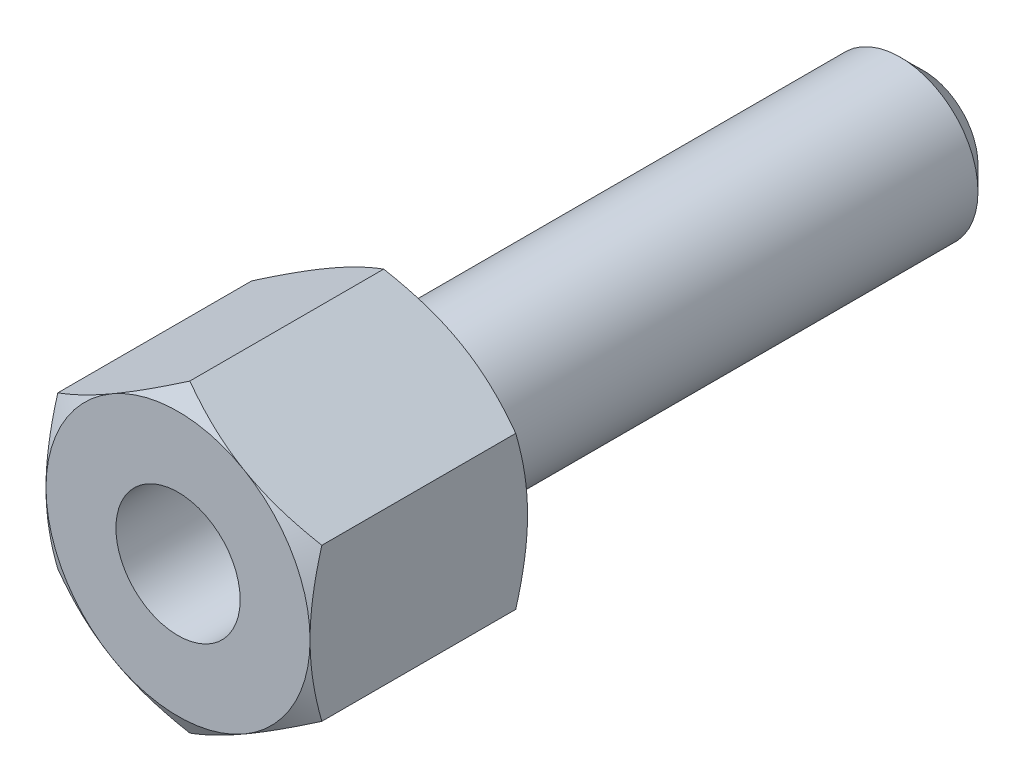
ISO-10303-21;
HEADER;
FILE_DESCRIPTION(('STEP AP214'),'2;1');
FILE_NAME('part.step','',(''),(''),'','','');
FILE_SCHEMA(('AUTOMOTIVE_DESIGN { 1 0 10303 214 1 1 1 1 }'));
ENDSEC;
DATA;
#1=APPLICATION_CONTEXT('core data for automotive mechanical design processes');
#2=APPLICATION_PROTOCOL_DEFINITION('international standard','automotive_design',2000,#1);
#3=PRODUCT_CONTEXT('',#1,'mechanical');
#4=PRODUCT('Part','Part','',(#3));
#5=PRODUCT_RELATED_PRODUCT_CATEGORY('part','',(#4));
#6=PRODUCT_DEFINITION_FORMATION('','',#4);
#7=PRODUCT_DEFINITION_CONTEXT('part definition',#1,'design');
#8=PRODUCT_DEFINITION('design','',#6,#7);
#9=PRODUCT_DEFINITION_SHAPE('','',#8);
#10=(LENGTH_UNIT() NAMED_UNIT(*) SI_UNIT(.MILLI.,.METRE.));
#11=(NAMED_UNIT(*) PLANE_ANGLE_UNIT() SI_UNIT($,.RADIAN.));
#12=(NAMED_UNIT(*) SI_UNIT($,.STERADIAN.) SOLID_ANGLE_UNIT());
#13=UNCERTAINTY_MEASURE_WITH_UNIT(LENGTH_MEASURE(1.E-05),#10,'distance_accuracy_value','');
#14=(GEOMETRIC_REPRESENTATION_CONTEXT(3) GLOBAL_UNCERTAINTY_ASSIGNED_CONTEXT((#13)) GLOBAL_UNIT_ASSIGNED_CONTEXT((#10,
#11,#12)) REPRESENTATION_CONTEXT('',''));
#15=CARTESIAN_POINT('',(0.,0.,0.));
#16=DIRECTION('',(0.,0.,1.));
#17=DIRECTION('',(1.,0.,0.));
#18=AXIS2_PLACEMENT_3D('',#15,#16,#17);
#19=CARTESIAN_POINT('',(8.5,4.90747728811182,14.));
#20=DIRECTION('',(-0.5,-0.866025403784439,0.));
#21=DIRECTION('',(0.866025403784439,-0.5,0.));
#22=AXIS2_PLACEMENT_3D('',#19,#20,#21);
#23=PLANE('',#22);
#24=CARTESIAN_POINT('',(-0.000200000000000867,9.81507004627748,0.75925604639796));
#25=CARTESIAN_POINT('',(0.186639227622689,9.70719836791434,0.696986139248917));
#26=CARTESIAN_POINT('',(0.374175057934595,9.59892450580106,0.637542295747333));
#27=CARTESIAN_POINT('',(0.75076975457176,9.3814974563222,0.525085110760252));
#28=CARTESIAN_POINT('',(0.939829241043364,9.27234391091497,0.472074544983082));
#29=CARTESIAN_POINT('',(1.51003475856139,8.94313560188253,0.323733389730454));
#30=CARTESIAN_POINT('',(1.89343164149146,8.72178130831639,0.239358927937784));
#31=CARTESIAN_POINT('',(2.46717766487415,8.39052888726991,0.140420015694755));
#32=CARTESIAN_POINT('',(2.65581276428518,8.28162036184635,0.112235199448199));
#33=CARTESIAN_POINT('',(3.0339360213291,8.06331079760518,0.0649740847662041));
#34=CARTESIAN_POINT('',(3.22342410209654,7.95390980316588,0.0458969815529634));
#35=CARTESIAN_POINT('',(3.6027265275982,7.73491944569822,0.0173347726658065));
#36=CARTESIAN_POINT('',(3.79254025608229,7.62533043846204,0.00783878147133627));
#37=CARTESIAN_POINT('',(4.17234305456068,7.40605119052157,-0.00135762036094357));
#38=CARTESIAN_POINT('',(4.36233211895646,7.29636095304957,-0.00105833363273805));
#39=CARTESIAN_POINT('',(4.71752301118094,7.09129139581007,0.00865447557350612));
#40=CARTESIAN_POINT('',(4.88274990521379,6.99589760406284,0.0168831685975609));
#41=CARTESIAN_POINT('',(5.21281671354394,6.80533344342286,0.0405892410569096));
#42=CARTESIAN_POINT('',(5.37765660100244,6.71016309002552,0.0560671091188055));
#43=CARTESIAN_POINT('',(5.87153810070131,6.4250204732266,0.113008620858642));
#44=CARTESIAN_POINT('',(6.19970550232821,6.23555293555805,0.164973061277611));
#45=CARTESIAN_POINT('',(6.85952142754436,5.8546080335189,0.294884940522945));
#46=CARTESIAN_POINT('',(7.19108574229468,5.66317928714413,0.373383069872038));
#47=CARTESIAN_POINT('',(7.84926989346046,5.28317649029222,0.551541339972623));
#48=CARTESIAN_POINT('',(8.17589815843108,5.09459757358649,0.651159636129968));
#49=CARTESIAN_POINT('',(8.5002,4.90736181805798,0.75925604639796));
#50=B_SPLINE_CURVE_WITH_KNOTS('',3,(#24,#25,#26,#27,#28,#29,#30,#31,#32,#33,#34,#35,#36,#37,#38,
#39,#40,#41,#42,#43,#44,#45,#46,#47,#48,#49),.UNSPECIFIED.,.F.,.F.,(4,2,2,2,2,2,2,2,2,2,2,2,4),
(0.,0.673596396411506,1.34748239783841,2.69805431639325,3.35679995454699,4.01548737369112,
4.67342558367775,5.33134346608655,5.90409556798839,6.47688628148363,7.62328361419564,
8.79510569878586,9.9646274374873),.UNSPECIFIED.);
#51=CARTESIAN_POINT('',(0.,9.81495457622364,0.759189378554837));
#52=VERTEX_POINT('',#51);
#53=CARTESIAN_POINT('',(4.25,7.36121593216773,0.));
#54=VERTEX_POINT('',#53);
#55=EDGE_CURVE('E29',#52,#54,#50,.T.);
#56=ORIENTED_EDGE('',*,*,#55,.F.);
#57=DIRECTION('',(0.,0.,-1.));
#58=VECTOR('',#57,1.);
#59=CARTESIAN_POINT('',(0.,9.81495457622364,14.));
#60=LINE('',#59,#58);
#61=CARTESIAN_POINT('',(0.,9.81495457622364,13.2408106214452));
#62=VERTEX_POINT('',#61);
#63=EDGE_CURVE('E288',#62,#52,#60,.T.);
#64=ORIENTED_EDGE('',*,*,#63,.F.);
#65=CARTESIAN_POINT('',(8.5002,4.90736181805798,13.240743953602));
#66=CARTESIAN_POINT('',(8.31336077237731,5.01523349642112,13.3030138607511));
#67=CARTESIAN_POINT('',(8.1258249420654,5.1235073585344,13.3624577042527));
#68=CARTESIAN_POINT('',(7.74923024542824,5.34093440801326,13.4749148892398));
#69=CARTESIAN_POINT('',(7.56017075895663,5.45008795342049,13.5279254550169));
#70=CARTESIAN_POINT('',(6.9899652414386,5.77929626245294,13.6762666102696));
#71=CARTESIAN_POINT('',(6.60656835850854,6.00065055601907,13.7606410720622));
#72=CARTESIAN_POINT('',(6.03282233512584,6.33190297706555,13.8595799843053));
#73=CARTESIAN_POINT('',(5.84418723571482,6.44081150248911,13.8877648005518));
#74=CARTESIAN_POINT('',(5.46606397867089,6.65912106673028,13.9350259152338));
#75=CARTESIAN_POINT('',(5.27657589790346,6.76852206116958,13.954103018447));
#76=CARTESIAN_POINT('',(4.8972734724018,6.98751241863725,13.9826652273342));
#77=CARTESIAN_POINT('',(4.70745974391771,7.09710142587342,13.9921612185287));
#78=CARTESIAN_POINT('',(4.32765694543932,7.3163806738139,14.0013576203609));
#79=CARTESIAN_POINT('',(4.13766788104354,7.42607091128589,14.0010583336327));
#80=CARTESIAN_POINT('',(3.78247698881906,7.63114046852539,13.9913455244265));
#81=CARTESIAN_POINT('',(3.6172500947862,7.72653426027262,13.9831168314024));
#82=CARTESIAN_POINT('',(3.28718328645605,7.9170984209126,13.9594107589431));
#83=CARTESIAN_POINT('',(3.12234339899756,8.01226877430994,13.9439328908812));
#84=CARTESIAN_POINT('',(2.62846189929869,8.29741139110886,13.8869913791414));
#85=CARTESIAN_POINT('',(2.30029449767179,8.48687892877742,13.8350269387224));
#86=CARTESIAN_POINT('',(1.64047857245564,8.86782383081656,13.7051150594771));
#87=CARTESIAN_POINT('',(1.30891425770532,9.05925257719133,13.626616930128));
#88=CARTESIAN_POINT('',(0.650730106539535,9.43925537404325,13.4484586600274));
#89=CARTESIAN_POINT('',(0.324101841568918,9.62783429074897,13.34884036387));
#90=CARTESIAN_POINT('',(-0.000200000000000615,9.81507004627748,13.240743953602));
#91=B_SPLINE_CURVE_WITH_KNOTS('',3,(#65,#66,#67,#68,#69,#70,#71,#72,#73,#74,#75,#76,#77,#78,#79,
#80,#81,#82,#83,#84,#85,#86,#87,#88,#89,#90),.UNSPECIFIED.,.F.,.F.,(4,2,2,2,2,2,2,2,2,2,2,2,4),
(0.,0.673596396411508,1.34748239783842,2.69805431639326,3.35679995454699,4.01548737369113,
4.67342558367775,5.33134346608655,5.90409556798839,6.47688628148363,7.62328361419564,
8.79510569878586,9.9646274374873),.UNSPECIFIED.);
#92=CARTESIAN_POINT('',(4.25,7.36121593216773,14.));
#93=VERTEX_POINT('',#92);
#94=EDGE_CURVE('E219',#93,#62,#91,.T.);
#95=ORIENTED_EDGE('',*,*,#94,.F.);
#96=CARTESIAN_POINT('',(8.5,4.90747728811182,13.2408106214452));
#97=VERTEX_POINT('',#96);
#98=EDGE_CURVE('E224',#97,#93,#91,.T.);
#99=ORIENTED_EDGE('',*,*,#98,.F.);
#100=DIRECTION('',(0.,0.,-1.));
#101=VECTOR('',#100,1.);
#102=CARTESIAN_POINT('',(8.5,4.90747728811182,14.));
#103=LINE('',#102,#101);
#104=CARTESIAN_POINT('',(8.5,4.90747728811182,0.759189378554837));
#105=VERTEX_POINT('',#104);
#106=EDGE_CURVE('E282',#97,#105,#103,.T.);
#107=ORIENTED_EDGE('',*,*,#106,.T.);
#108=EDGE_CURVE('E111',#54,#105,#50,.T.);
#109=ORIENTED_EDGE('',*,*,#108,.F.);
#110=EDGE_LOOP('',(#56,#64,#95,#99,#107,#109));
#111=FACE_BOUND('',#110,.T.);
#112=ADVANCED_FACE('F14',(#111),#23,.F.);
#113=CARTESIAN_POINT('',(8.5,-4.90747728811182,14.));
#114=DIRECTION('',(-1.,0.,0.));
#115=DIRECTION('',(0.,-1.,0.));
#116=AXIS2_PLACEMENT_3D('',#113,#114,#115);
#117=PLANE('',#116);
#118=CARTESIAN_POINT('',(8.5,-13.3548775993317,4.23223014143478));
#119=CARTESIAN_POINT('',(8.5,-12.9821516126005,4.05073665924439));
#120=CARTESIAN_POINT('',(8.5,-12.6085883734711,3.87093407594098));
#121=CARTESIAN_POINT('',(8.5,-11.8593427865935,3.51565832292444));
#122=CARTESIAN_POINT('',(8.5,-11.4836601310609,3.34018580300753));
#123=CARTESIAN_POINT('',(8.5,-10.7278769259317,2.9936715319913));
#124=CARTESIAN_POINT('',(8.5,-10.3477635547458,2.82265765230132));
#125=CARTESIAN_POINT('',(8.5,-9.58457357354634,2.48740086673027));
#126=CARTESIAN_POINT('',(8.5,-9.20149709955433,2.32315765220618));
#127=CARTESIAN_POINT('',(8.5,-8.41874027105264,1.99780750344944));
#128=CARTESIAN_POINT('',(8.5,-8.01893686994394,1.83699501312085));
#129=CARTESIAN_POINT('',(8.5,-7.21471775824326,1.52712768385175));
#130=CARTESIAN_POINT('',(8.5,-6.8103015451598,1.37807414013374));
#131=CARTESIAN_POINT('',(8.5,-5.99691134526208,1.09551203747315));
#132=CARTESIAN_POINT('',(8.5,-5.58794790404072,0.961973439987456));
#133=CARTESIAN_POINT('',(8.5,-4.7641709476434,0.714610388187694));
#134=CARTESIAN_POINT('',(8.5,-4.34935926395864,0.600779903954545));
#135=CARTESIAN_POINT('',(8.5,-3.51593005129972,0.398804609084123));
#136=CARTESIAN_POINT('',(8.5,-3.09734890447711,0.310513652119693));
#137=CARTESIAN_POINT('',(8.5,-2.46553071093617,0.200960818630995));
#138=CARTESIAN_POINT('',(8.5,-2.25425258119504,0.168255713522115));
#139=CARTESIAN_POINT('',(8.5,-1.83058844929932,0.111110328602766));
#140=CARTESIAN_POINT('',(8.5,-1.61820255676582,0.0866692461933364));
#141=CARTESIAN_POINT('',(8.5,-1.1954568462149,0.0468546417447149));
#142=CARTESIAN_POINT('',(8.5,-0.985108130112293,0.0313637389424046));
#143=CARTESIAN_POINT('',(8.5,-0.563943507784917,0.00929871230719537));
#144=CARTESIAN_POINT('',(8.5,-0.353127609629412,0.0027244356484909));
#145=CARTESIAN_POINT('',(8.5,0.0685932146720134,-0.00134976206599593));
#146=CARTESIAN_POINT('',(8.5,0.279498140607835,0.00115029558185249));
#147=CARTESIAN_POINT('',(8.5,0.701010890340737,0.015161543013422));
#148=CARTESIAN_POINT('',(8.5,0.911618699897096,0.0266731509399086));
#149=CARTESIAN_POINT('',(8.5,1.41263683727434,0.0645294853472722));
#150=CARTESIAN_POINT('',(8.5,1.70275254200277,0.0948640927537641));
#151=CARTESIAN_POINT('',(8.5,2.28092909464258,0.171016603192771));
#152=CARTESIAN_POINT('',(8.5,2.5689896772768,0.216836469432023));
#153=CARTESIAN_POINT('',(8.5,3.42970517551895,0.375102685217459));
#154=CARTESIAN_POINT('',(8.5,3.99859505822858,0.508329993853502));
#155=CARTESIAN_POINT('',(8.5,4.84945753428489,0.740613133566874));
#156=CARTESIAN_POINT('',(8.5,5.13580962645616,0.824560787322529));
#157=CARTESIAN_POINT('',(8.5,5.70573615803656,1.00149139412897));
#158=CARTESIAN_POINT('',(8.5,5.98931057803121,1.09447441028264));
#159=CARTESIAN_POINT('',(8.5,6.55376469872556,1.28795785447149));
#160=CARTESIAN_POINT('',(8.5,6.83464517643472,1.38845603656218));
#161=CARTESIAN_POINT('',(8.5,7.39405811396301,1.59575599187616));
#162=CARTESIAN_POINT('',(8.5,7.67259060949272,1.70255766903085));
#163=CARTESIAN_POINT('',(8.5,8.35968227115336,1.97352621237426));
#164=CARTESIAN_POINT('',(8.5,8.76701549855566,2.14079698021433));
#165=CARTESIAN_POINT('',(8.5,9.57793810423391,2.48420830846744));
#166=CARTESIAN_POINT('',(8.5,9.98152718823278,2.66034955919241));
#167=CARTESIAN_POINT('',(8.5,10.7857093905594,3.01962100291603));
#168=CARTESIAN_POINT('',(8.5,11.1863016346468,3.20275314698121));
#169=CARTESIAN_POINT('',(8.5,11.9849090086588,3.57450935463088));
#170=CARTESIAN_POINT('',(8.5,12.3829242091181,3.76313326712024));
#171=CARTESIAN_POINT('',(8.5,13.1773443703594,4.14503575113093));
#172=CARTESIAN_POINT('',(8.5,13.5737465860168,4.33832002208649));
#173=CARTESIAN_POINT('',(8.5,14.3647821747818,4.72847487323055));
#174=CARTESIAN_POINT('',(8.5,14.7594155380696,4.92534547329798));
#175=CARTESIAN_POINT('',(8.5,15.5471361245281,5.32199521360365));
#176=CARTESIAN_POINT('',(8.5,15.9402235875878,5.52177387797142));
#177=CARTESIAN_POINT('',(8.5,16.7251493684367,5.92377162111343));
#178=CARTESIAN_POINT('',(8.5,17.1169876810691,6.12599070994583));
#179=CARTESIAN_POINT('',(8.5,18.219430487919,6.69856755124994));
#180=CARTESIAN_POINT('',(8.49999999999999,18.9288195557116,7.07126528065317));
#181=CARTESIAN_POINT('',(8.49999999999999,20.3450007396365,7.82162613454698));
#182=CARTESIAN_POINT('',(8.49999999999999,21.051792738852,8.19928947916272));
#183=CARTESIAN_POINT('',(8.49999999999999,22.4613295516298,8.95729533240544));
#184=CARTESIAN_POINT('',(8.49999999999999,23.1640801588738,9.3376270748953));
#185=CARTESIAN_POINT('',(8.49999999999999,24.2169955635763,9.91029454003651));
#186=CARTESIAN_POINT('',(8.49999999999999,24.567754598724,10.1015392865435));
#187=CARTESIAN_POINT('',(8.49999999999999,25.2689169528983,10.4846784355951));
#188=CARTESIAN_POINT('',(8.5,25.6193202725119,10.6765728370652));
#189=CARTESIAN_POINT('',(8.5,25.9695665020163,10.8687536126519));
#190=B_SPLINE_CURVE_WITH_KNOTS('',3,(#118,#119,#120,#121,#122,#123,#124,#125,#126,#127,#128,
#129,#130,#131,#132,#133,#134,#135,#136,#137,#138,#139,#140,#141,#142,#143,#144,#145,#146,#147,
#148,#149,#150,#151,#152,#153,#154,#155,#156,#157,#158,#159,#160,#161,#162,#163,#164,#165,#166,
#167,#168,#169,#170,#171,#172,#173,#174,#175,#176,#177,#178,#179,#180,#181,#182,#183,#184,#185,
#186,#187,#188,#189),.UNSPECIFIED.,.F.,.F.,(4,2,2,2,2,2,2,2,2,2,2,2,2,2,2,2,2,2,2,2,2,2,2,2,2,2,
2,2,2,2,2,2,2,2,2,4),(0.,1.2437108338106,2.48760718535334,3.7379890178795,4.988313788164,
6.28096970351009,7.57376780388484,8.86401966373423,10.1538760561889,11.4361984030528,
12.0774457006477,12.7186307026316,13.3512036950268,13.9837658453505,14.616326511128,
15.2489165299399,16.1235177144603,16.9982298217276,18.7485496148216,19.6436811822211,
20.5388190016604,21.4336903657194,22.3285480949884,23.6494233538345,24.970401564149,
26.2917511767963,27.6130644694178,28.9360850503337,30.2591129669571,31.5819267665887,
32.9047460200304,35.3087183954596,37.7127977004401,40.1099940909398,41.3085168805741,
42.5070376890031),.UNSPECIFIED.);
#191=CARTESIAN_POINT('',(8.5,0.,0.));
#192=VERTEX_POINT('',#191);
#193=EDGE_CURVE('E104',#105,#192,#190,.F.);
#194=ORIENTED_EDGE('',*,*,#193,.F.);
#195=ORIENTED_EDGE('',*,*,#106,.F.);
#196=CARTESIAN_POINT('',(8.5,-13.3548775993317,9.76776985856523));
#197=CARTESIAN_POINT('',(8.5,-12.9821516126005,9.94926334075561));
#198=CARTESIAN_POINT('',(8.5,-12.6085883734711,10.129065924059));
#199=CARTESIAN_POINT('',(8.5,-11.8593427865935,10.4843416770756));
#200=CARTESIAN_POINT('',(8.5,-11.4836601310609,10.6598141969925));
#201=CARTESIAN_POINT('',(8.5,-10.7278769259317,11.0063284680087));
#202=CARTESIAN_POINT('',(8.5,-10.3477635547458,11.1773423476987));
#203=CARTESIAN_POINT('',(8.5,-9.58457357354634,11.5125991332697));
#204=CARTESIAN_POINT('',(8.5,-9.20149709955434,11.6768423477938));
#205=CARTESIAN_POINT('',(8.5,-8.41874027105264,12.0021924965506));
#206=CARTESIAN_POINT('',(8.5,-8.01893686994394,12.1630049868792));
#207=CARTESIAN_POINT('',(8.5,-7.21471775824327,12.4728723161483));
#208=CARTESIAN_POINT('',(8.5,-6.8103015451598,12.6219258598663));
#209=CARTESIAN_POINT('',(8.5,-5.99691134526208,12.9044879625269));
#210=CARTESIAN_POINT('',(8.5,-5.58794790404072,13.0380265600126));
#211=CARTESIAN_POINT('',(8.5,-4.7641709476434,13.2853896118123));
#212=CARTESIAN_POINT('',(8.5,-4.34935926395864,13.3992200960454));
#213=CARTESIAN_POINT('',(8.5,-3.51593005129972,13.6011953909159));
#214=CARTESIAN_POINT('',(8.5,-3.09734890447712,13.6894863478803));
#215=CARTESIAN_POINT('',(8.5,-2.46553071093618,13.799039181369));
#216=CARTESIAN_POINT('',(8.5,-2.25425258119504,13.8317442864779));
#217=CARTESIAN_POINT('',(8.5,-1.83058844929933,13.8888896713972));
#218=CARTESIAN_POINT('',(8.5,-1.61820255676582,13.9133307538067));
#219=CARTESIAN_POINT('',(8.5,-1.1954568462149,13.9531453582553));
#220=CARTESIAN_POINT('',(8.5,-0.985108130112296,13.9686362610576));
#221=CARTESIAN_POINT('',(8.5,-0.563943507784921,13.9907012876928));
#222=CARTESIAN_POINT('',(8.5,-0.353127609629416,13.9972755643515));
#223=CARTESIAN_POINT('',(8.5,0.06859321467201,14.001349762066));
#224=CARTESIAN_POINT('',(8.5,0.279498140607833,13.9988497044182));
#225=CARTESIAN_POINT('',(8.5,0.701010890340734,13.9848384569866));
#226=CARTESIAN_POINT('',(8.5,0.911618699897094,13.9733268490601));
#227=CARTESIAN_POINT('',(8.5,1.41263683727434,13.9354705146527));
#228=CARTESIAN_POINT('',(8.5,1.70275254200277,13.9051359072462));
#229=CARTESIAN_POINT('',(8.5,2.28092909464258,13.8289833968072));
#230=CARTESIAN_POINT('',(8.5,2.5689896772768,13.783163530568));
#231=CARTESIAN_POINT('',(8.5,3.42970517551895,13.6248973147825));
#232=CARTESIAN_POINT('',(8.5,3.99859505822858,13.4916700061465));
#233=CARTESIAN_POINT('',(8.5,4.84945753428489,13.2593868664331));
#234=CARTESIAN_POINT('',(8.5,5.13580962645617,13.1754392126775));
#235=CARTESIAN_POINT('',(8.5,5.70573615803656,12.998508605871));
#236=CARTESIAN_POINT('',(8.5,5.98931057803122,12.9055255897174));
#237=CARTESIAN_POINT('',(8.5,6.55376469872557,12.7120421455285));
#238=CARTESIAN_POINT('',(8.5,6.83464517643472,12.6115439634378));
#239=CARTESIAN_POINT('',(8.5,7.39405811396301,12.4042440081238));
#240=CARTESIAN_POINT('',(8.5,7.67259060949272,12.2974423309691));
#241=CARTESIAN_POINT('',(8.5,8.35968227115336,12.0264737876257));
#242=CARTESIAN_POINT('',(8.5,8.76701549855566,11.8592030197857));
#243=CARTESIAN_POINT('',(8.5,9.57793810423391,11.5157916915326));
#244=CARTESIAN_POINT('',(8.5,9.98152718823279,11.3396504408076));
#245=CARTESIAN_POINT('',(8.5,10.7857093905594,10.980378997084));
#246=CARTESIAN_POINT('',(8.5,11.1863016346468,10.7972468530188));
#247=CARTESIAN_POINT('',(8.5,11.9849090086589,10.4254906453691));
#248=CARTESIAN_POINT('',(8.5,12.3829242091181,10.2368667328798));
#249=CARTESIAN_POINT('',(8.5,13.1773443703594,9.85496424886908));
#250=CARTESIAN_POINT('',(8.5,13.5737465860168,9.66167997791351));
#251=CARTESIAN_POINT('',(8.5,14.3647821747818,9.27152512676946));
#252=CARTESIAN_POINT('',(8.5,14.7594155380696,9.07465452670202));
#253=CARTESIAN_POINT('',(8.5,15.5471361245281,8.67800478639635));
#254=CARTESIAN_POINT('',(8.5,15.9402235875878,8.47822612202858));
#255=CARTESIAN_POINT('',(8.5,16.7251493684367,8.07622837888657));
#256=CARTESIAN_POINT('',(8.5,17.1169876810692,7.87400929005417));
#257=CARTESIAN_POINT('',(8.5,18.219430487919,7.30143244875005));
#258=CARTESIAN_POINT('',(8.49999999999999,18.9288195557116,6.92873471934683));
#259=CARTESIAN_POINT('',(8.49999999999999,20.3450007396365,6.17837386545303));
#260=CARTESIAN_POINT('',(8.49999999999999,21.051792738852,5.80071052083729));
#261=CARTESIAN_POINT('',(8.49999999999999,22.4613295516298,5.04270466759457));
#262=CARTESIAN_POINT('',(8.49999999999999,23.1640801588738,4.6623729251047));
#263=CARTESIAN_POINT('',(8.49999999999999,24.2169955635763,4.08970545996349));
#264=CARTESIAN_POINT('',(8.49999999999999,24.567754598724,3.8984607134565));
#265=CARTESIAN_POINT('',(8.49999999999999,25.2689169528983,3.51532156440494));
#266=CARTESIAN_POINT('',(8.5,25.6193202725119,3.32342716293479));
#267=CARTESIAN_POINT('',(8.5,25.9695665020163,3.13124638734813));
#268=B_SPLINE_CURVE_WITH_KNOTS('',3,(#196,#197,#198,#199,#200,#201,#202,#203,#204,#205,#206,
#207,#208,#209,#210,#211,#212,#213,#214,#215,#216,#217,#218,#219,#220,#221,#222,#223,#224,#225,
#226,#227,#228,#229,#230,#231,#232,#233,#234,#235,#236,#237,#238,#239,#240,#241,#242,#243,#244,
#245,#246,#247,#248,#249,#250,#251,#252,#253,#254,#255,#256,#257,#258,#259,#260,#261,#262,#263,
#264,#265,#266,#267),.UNSPECIFIED.,.F.,.F.,(4,2,2,2,2,2,2,2,2,2,2,2,2,2,2,2,2,2,2,2,2,2,2,2,2,2,
2,2,2,2,2,2,2,2,2,4),(0.,1.2437108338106,2.48760718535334,3.7379890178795,4.988313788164,
6.28096970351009,7.57376780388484,8.86401966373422,10.1538760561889,11.4361984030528,
12.0774457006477,12.7186307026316,13.3512036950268,13.9837658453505,14.616326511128,
15.2489165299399,16.1235177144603,16.9982298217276,18.7485496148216,19.6436811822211,
20.5388190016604,21.4336903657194,22.3285480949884,23.6494233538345,24.970401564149,
26.2917511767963,27.6130644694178,28.9360850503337,30.2591129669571,31.5819267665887,
32.9047460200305,35.3087183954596,37.7127977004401,40.1099940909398,41.3085168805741,
42.5070376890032),.UNSPECIFIED.);
#269=CARTESIAN_POINT('',(8.5,0.,14.));
#270=VERTEX_POINT('',#269);
#271=EDGE_CURVE('E170',#270,#97,#268,.T.);
#272=ORIENTED_EDGE('',*,*,#271,.F.);
#273=CARTESIAN_POINT('',(8.5,-4.9074772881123,13.2408106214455));
#274=VERTEX_POINT('',#273);
#275=EDGE_CURVE('E177',#274,#270,#268,.T.);
#276=ORIENTED_EDGE('',*,*,#275,.F.);
#277=DIRECTION('',(0.,0.,-1.));
#278=VECTOR('',#277,1.);
#279=CARTESIAN_POINT('',(8.5,-4.90747728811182,14.));
#280=LINE('',#279,#278);
#281=CARTESIAN_POINT('',(8.5,-4.90747728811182,0.759189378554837));
#282=VERTEX_POINT('',#281);
#283=EDGE_CURVE('E136',#274,#282,#280,.T.);
#284=ORIENTED_EDGE('',*,*,#283,.T.);
#285=EDGE_CURVE('E116',#192,#282,#190,.F.);
#286=ORIENTED_EDGE('',*,*,#285,.F.);
#287=EDGE_LOOP('',(#194,#195,#272,#276,#284,#286));
#288=FACE_BOUND('',#287,.T.);
#289=ADVANCED_FACE('F133',(#288),#117,.F.);
#290=CARTESIAN_POINT('',(0.,-9.81495457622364,14.));
#291=DIRECTION('',(-0.5,0.866025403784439,0.));
#292=DIRECTION('',(-0.866025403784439,-0.5,0.));
#293=AXIS2_PLACEMENT_3D('',#290,#291,#292);
#294=PLANE('',#293);
#295=CARTESIAN_POINT('',(8.5002,-4.90736181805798,0.75925604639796));
#296=CARTESIAN_POINT('',(8.31336077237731,-5.01523349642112,0.696986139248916));
#297=CARTESIAN_POINT('',(8.1258249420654,-5.1235073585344,0.637542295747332));
#298=CARTESIAN_POINT('',(7.74923024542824,-5.34093440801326,0.525085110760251));
#299=CARTESIAN_POINT('',(7.56017075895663,-5.45008795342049,0.472074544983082));
#300=CARTESIAN_POINT('',(6.9899652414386,-5.77929626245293,0.323733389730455));
#301=CARTESIAN_POINT('',(6.60656835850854,-6.00065055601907,0.239358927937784));
#302=CARTESIAN_POINT('',(6.03282233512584,-6.33190297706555,0.140420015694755));
#303=CARTESIAN_POINT('',(5.84418723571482,-6.44081150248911,0.112235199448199));
#304=CARTESIAN_POINT('',(5.4660639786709,-6.65912106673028,0.0649740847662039));
#305=CARTESIAN_POINT('',(5.27657589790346,-6.76852206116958,0.0458969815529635));
#306=CARTESIAN_POINT('',(4.8972734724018,-6.98751241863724,0.0173347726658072));
#307=CARTESIAN_POINT('',(4.70745974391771,-7.09710142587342,0.00783878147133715));
#308=CARTESIAN_POINT('',(4.32765694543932,-7.31638067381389,-0.0013576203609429));
#309=CARTESIAN_POINT('',(4.13766788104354,-7.42607091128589,-0.00105833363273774));
#310=CARTESIAN_POINT('',(3.78247698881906,-7.63114046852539,0.00865447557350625));
#311=CARTESIAN_POINT('',(3.61725009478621,-7.72653426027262,0.0168831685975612));
#312=CARTESIAN_POINT('',(3.28718328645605,-7.9170984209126,0.0405892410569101));
#313=CARTESIAN_POINT('',(3.12234339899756,-8.01226877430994,0.0560671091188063));
#314=CARTESIAN_POINT('',(2.62846189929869,-8.29741139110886,0.113008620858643));
#315=CARTESIAN_POINT('',(2.30029449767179,-8.48687892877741,0.164973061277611));
#316=CARTESIAN_POINT('',(1.64047857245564,-8.86782383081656,0.294884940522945));
#317=CARTESIAN_POINT('',(1.30891425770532,-9.05925257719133,0.373383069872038));
#318=CARTESIAN_POINT('',(0.650730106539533,-9.43925537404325,0.551541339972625));
#319=CARTESIAN_POINT('',(0.324101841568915,-9.62783429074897,0.65115963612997));
#320=CARTESIAN_POINT('',(-0.000200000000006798,-9.81507004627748,0.759256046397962));
#321=B_SPLINE_CURVE_WITH_KNOTS('',3,(#295,#296,#297,#298,#299,#300,#301,#302,#303,#304,#305,
#306,#307,#308,#309,#310,#311,#312,#313,#314,#315,#316,#317,#318,#319,#320),.UNSPECIFIED.,.F.,
.F.,(4,2,2,2,2,2,2,2,2,2,2,2,4),(0.,0.673596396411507,1.34748239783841,2.69805431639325,
3.35679995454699,4.01548737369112,4.67342558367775,5.33134346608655,5.90409556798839,
6.47688628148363,7.62328361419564,8.79510569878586,9.9646274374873),.UNSPECIFIED.);
#322=CARTESIAN_POINT('',(4.25,-7.36121593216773,0.));
#323=VERTEX_POINT('',#322);
#324=EDGE_CURVE('E123',#282,#323,#321,.T.);
#325=ORIENTED_EDGE('',*,*,#324,.F.);
#326=ORIENTED_EDGE('',*,*,#283,.F.);
#327=CARTESIAN_POINT('',(-0.0002000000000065,-9.81507004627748,13.240743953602));
#328=CARTESIAN_POINT('',(0.186639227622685,-9.70719836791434,13.3030138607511));
#329=CARTESIAN_POINT('',(0.374175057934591,-9.59892450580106,13.3624577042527));
#330=CARTESIAN_POINT('',(0.750769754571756,-9.3814974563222,13.4749148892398));
#331=CARTESIAN_POINT('',(0.93982924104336,-9.27234391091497,13.5279254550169));
#332=CARTESIAN_POINT('',(1.51003475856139,-8.94313560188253,13.6762666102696));
#333=CARTESIAN_POINT('',(1.89343164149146,-8.72178130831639,13.7606410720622));
#334=CARTESIAN_POINT('',(2.46717766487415,-8.39052888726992,13.8595799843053));
#335=CARTESIAN_POINT('',(2.65581276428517,-8.28162036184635,13.8877648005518));
#336=CARTESIAN_POINT('',(3.0339360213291,-8.06331079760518,13.9350259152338));
#337=CARTESIAN_POINT('',(3.22342410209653,-7.95390980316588,13.954103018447));
#338=CARTESIAN_POINT('',(3.60272652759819,-7.73491944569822,13.9826652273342));
#339=CARTESIAN_POINT('',(3.79254025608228,-7.62533043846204,13.9921612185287));
#340=CARTESIAN_POINT('',(4.17234305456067,-7.40605119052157,14.0013576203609));
#341=CARTESIAN_POINT('',(4.36233211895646,-7.29636095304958,14.0010583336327));
#342=CARTESIAN_POINT('',(4.71752301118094,-7.09129139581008,13.9913455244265));
#343=CARTESIAN_POINT('',(4.88274990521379,-6.99589760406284,13.9831168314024));
#344=CARTESIAN_POINT('',(5.21281671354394,-6.80533344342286,13.9594107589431));
#345=CARTESIAN_POINT('',(5.37765660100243,-6.71016309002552,13.9439328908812));
#346=CARTESIAN_POINT('',(5.8715381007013,-6.4250204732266,13.8869913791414));
#347=CARTESIAN_POINT('',(6.1997055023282,-6.23555293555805,13.8350269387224));
#348=CARTESIAN_POINT('',(6.85952142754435,-5.8546080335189,13.7051150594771));
#349=CARTESIAN_POINT('',(7.19108574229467,-5.66317928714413,13.626616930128));
#350=CARTESIAN_POINT('',(7.84926989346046,-5.28317649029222,13.4484586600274));
#351=CARTESIAN_POINT('',(8.17589815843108,-5.09459757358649,13.34884036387));
#352=CARTESIAN_POINT('',(8.5002,-4.90736181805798,13.240743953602));
#353=B_SPLINE_CURVE_WITH_KNOTS('',3,(#327,#328,#329,#330,#331,#332,#333,#334,#335,#336,#337,
#338,#339,#340,#341,#342,#343,#344,#345,#346,#347,#348,#349,#350,#351,#352),.UNSPECIFIED.,.F.,
.F.,(4,2,2,2,2,2,2,2,2,2,2,2,4),(0.,0.673596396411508,1.34748239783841,2.69805431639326,
3.35679995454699,4.01548737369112,4.67342558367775,5.33134346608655,5.90409556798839,
6.47688628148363,7.62328361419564,8.79510569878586,9.96462743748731),.UNSPECIFIED.);
#354=CARTESIAN_POINT('',(4.25,-7.36121593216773,14.));
#355=VERTEX_POINT('',#354);
#356=EDGE_CURVE('E184',#355,#274,#353,.T.);
#357=ORIENTED_EDGE('',*,*,#356,.F.);
#358=CARTESIAN_POINT('',(0.,-9.81495457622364,13.2408106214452));
#359=VERTEX_POINT('',#358);
#360=EDGE_CURVE('E277',#359,#355,#353,.T.);
#361=ORIENTED_EDGE('',*,*,#360,.F.);
#362=DIRECTION('',(0.,0.,-1.));
#363=VECTOR('',#362,1.);
#364=CARTESIAN_POINT('',(0.,-9.81495457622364,14.));
#365=LINE('',#364,#363);
#366=CARTESIAN_POINT('',(0.,-9.81495457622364,0.759189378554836));
#367=VERTEX_POINT('',#366);
#368=EDGE_CURVE('E272',#359,#367,#365,.T.);
#369=ORIENTED_EDGE('',*,*,#368,.T.);
#370=EDGE_CURVE('E137',#323,#367,#321,.T.);
#371=ORIENTED_EDGE('',*,*,#370,.F.);
#372=EDGE_LOOP('',(#325,#326,#357,#361,#369,#371));
#373=FACE_BOUND('',#372,.T.);
#374=ADVANCED_FACE('F163',(#373),#294,.F.);
#375=CARTESIAN_POINT('',(-8.5,-4.90747728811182,14.));
#376=DIRECTION('',(0.5,0.866025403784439,0.));
#377=DIRECTION('',(-0.866025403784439,0.5,0.));
#378=AXIS2_PLACEMENT_3D('',#375,#376,#377);
#379=PLANE('',#378);
#380=CARTESIAN_POINT('',(0.000199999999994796,-9.81507004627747,0.759256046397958));
#381=CARTESIAN_POINT('',(-0.186639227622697,-9.70719836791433,0.696986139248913));
#382=CARTESIAN_POINT('',(-0.374175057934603,-9.59892450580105,0.637542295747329));
#383=CARTESIAN_POINT('',(-0.750769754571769,-9.3814974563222,0.525085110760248));
#384=CARTESIAN_POINT('',(-0.939829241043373,-9.27234391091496,0.47207454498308));
#385=CARTESIAN_POINT('',(-1.5100347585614,-8.94313560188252,0.323733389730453));
#386=CARTESIAN_POINT('',(-1.89343164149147,-8.72178130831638,0.239358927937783));
#387=CARTESIAN_POINT('',(-2.46717766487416,-8.39052888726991,0.140420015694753));
#388=CARTESIAN_POINT('',(-2.65581276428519,-8.28162036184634,0.112235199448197));
#389=CARTESIAN_POINT('',(-3.03393602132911,-8.06331079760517,0.0649740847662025));
#390=CARTESIAN_POINT('',(-3.22342410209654,-7.95390980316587,0.0458969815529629));
#391=CARTESIAN_POINT('',(-3.6027265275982,-7.73491944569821,0.0173347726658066));
#392=CARTESIAN_POINT('',(-3.79254025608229,-7.62533043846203,0.00783878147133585));
#393=CARTESIAN_POINT('',(-4.17234305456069,-7.40605119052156,-0.00135762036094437));
#394=CARTESIAN_POINT('',(-4.36233211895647,-7.29636095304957,-0.00105833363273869));
#395=CARTESIAN_POINT('',(-4.71752301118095,-7.09129139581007,0.0086544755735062));
#396=CARTESIAN_POINT('',(-4.8827499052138,-6.99589760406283,0.0168831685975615));
#397=CARTESIAN_POINT('',(-5.21281671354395,-6.80533344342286,0.0405892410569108));
#398=CARTESIAN_POINT('',(-5.37765660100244,-6.71016309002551,0.056067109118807));
#399=CARTESIAN_POINT('',(-5.87153810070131,-6.42502047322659,0.113008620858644));
#400=CARTESIAN_POINT('',(-6.19970550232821,-6.23555293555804,0.164973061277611));
#401=CARTESIAN_POINT('',(-6.85952142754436,-5.8546080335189,0.294884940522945));
#402=CARTESIAN_POINT('',(-7.19108574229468,-5.66317928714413,0.373383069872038));
#403=CARTESIAN_POINT('',(-7.84926989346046,-5.28317649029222,0.551541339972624));
#404=CARTESIAN_POINT('',(-8.17589815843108,-5.09459757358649,0.651159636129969));
#405=CARTESIAN_POINT('',(-8.5002,-4.90736181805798,0.75925604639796));
#406=B_SPLINE_CURVE_WITH_KNOTS('',3,(#380,#381,#382,#383,#384,#385,#386,#387,#388,#389,#390,
#391,#392,#393,#394,#395,#396,#397,#398,#399,#400,#401,#402,#403,#404,#405),.UNSPECIFIED.,.F.,
.F.,(4,2,2,2,2,2,2,2,2,2,2,2,4),(0.,0.673596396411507,1.34748239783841,2.69805431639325,
3.35679995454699,4.01548737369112,4.67342558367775,5.33134346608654,5.90409556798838,
6.47688628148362,7.62328361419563,8.79510569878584,9.96462743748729),.UNSPECIFIED.);
#407=CARTESIAN_POINT('',(-4.25,-7.36121593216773,0.));
#408=VERTEX_POINT('',#407);
#409=EDGE_CURVE('E253',#367,#408,#406,.T.);
#410=ORIENTED_EDGE('',*,*,#409,.F.);
#411=ORIENTED_EDGE('',*,*,#368,.F.);
#412=CARTESIAN_POINT('',(-8.5002,-4.90736181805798,13.240743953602));
#413=CARTESIAN_POINT('',(-8.31336077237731,-5.01523349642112,13.3030138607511));
#414=CARTESIAN_POINT('',(-8.1258249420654,-5.1235073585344,13.3624577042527));
#415=CARTESIAN_POINT('',(-7.74923024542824,-5.34093440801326,13.4749148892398));
#416=CARTESIAN_POINT('',(-7.56017075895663,-5.45008795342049,13.5279254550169));
#417=CARTESIAN_POINT('',(-6.9899652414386,-5.77929626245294,13.6762666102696));
#418=CARTESIAN_POINT('',(-6.60656835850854,-6.00065055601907,13.7606410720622));
#419=CARTESIAN_POINT('',(-6.03282233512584,-6.33190297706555,13.8595799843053));
#420=CARTESIAN_POINT('',(-5.84418723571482,-6.44081150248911,13.8877648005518));
#421=CARTESIAN_POINT('',(-5.46606397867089,-6.65912106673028,13.9350259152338));
#422=CARTESIAN_POINT('',(-5.27657589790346,-6.76852206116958,13.954103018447));
#423=CARTESIAN_POINT('',(-4.8972734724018,-6.98751241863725,13.9826652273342));
#424=CARTESIAN_POINT('',(-4.70745974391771,-7.09710142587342,13.9921612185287));
#425=CARTESIAN_POINT('',(-4.32765694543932,-7.3163806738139,14.0013576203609));
#426=CARTESIAN_POINT('',(-4.13766788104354,-7.42607091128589,14.0010583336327));
#427=CARTESIAN_POINT('',(-3.78247698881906,-7.63114046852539,13.9913455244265));
#428=CARTESIAN_POINT('',(-3.6172500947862,-7.72653426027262,13.9831168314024));
#429=CARTESIAN_POINT('',(-3.28718328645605,-7.9170984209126,13.9594107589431));
#430=CARTESIAN_POINT('',(-3.12234339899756,-8.01226877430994,13.9439328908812));
#431=CARTESIAN_POINT('',(-2.62846189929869,-8.29741139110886,13.8869913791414));
#432=CARTESIAN_POINT('',(-2.30029449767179,-8.48687892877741,13.8350269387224));
#433=CARTESIAN_POINT('',(-1.64047857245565,-8.86782383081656,13.7051150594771));
#434=CARTESIAN_POINT('',(-1.30891425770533,-9.05925257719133,13.626616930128));
#435=CARTESIAN_POINT('',(-0.650730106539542,-9.43925537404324,13.4484586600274));
#436=CARTESIAN_POINT('',(-0.324101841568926,-9.62783429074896,13.34884036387));
#437=CARTESIAN_POINT('',(0.000199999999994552,-9.81507004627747,13.240743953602));
#438=B_SPLINE_CURVE_WITH_KNOTS('',3,(#412,#413,#414,#415,#416,#417,#418,#419,#420,#421,#422,
#423,#424,#425,#426,#427,#428,#429,#430,#431,#432,#433,#434,#435,#436,#437),.UNSPECIFIED.,.F.,
.F.,(4,2,2,2,2,2,2,2,2,2,2,2,4),(0.,0.673596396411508,1.34748239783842,2.69805431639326,
3.35679995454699,4.01548737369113,4.67342558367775,5.33134346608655,5.90409556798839,
6.47688628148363,7.62328361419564,8.79510569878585,9.96462743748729),.UNSPECIFIED.);
#439=CARTESIAN_POINT('',(-4.25,-7.36121593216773,14.));
#440=VERTEX_POINT('',#439);
#441=EDGE_CURVE('E315',#440,#359,#438,.T.);
#442=ORIENTED_EDGE('',*,*,#441,.F.);
#443=CARTESIAN_POINT('',(-8.5,-4.9074772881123,13.2408106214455));
#444=VERTEX_POINT('',#443);
#445=EDGE_CURVE('E178',#444,#440,#438,.T.);
#446=ORIENTED_EDGE('',*,*,#445,.F.);
#447=DIRECTION('',(0.,0.,-1.));
#448=VECTOR('',#447,1.);
#449=CARTESIAN_POINT('',(-8.5,-4.90747728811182,14.));
#450=LINE('',#449,#448);
#451=CARTESIAN_POINT('',(-8.5,-4.9074772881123,0.75918937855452));
#452=VERTEX_POINT('',#451);
#453=EDGE_CURVE('E278',#444,#452,#450,.T.);
#454=ORIENTED_EDGE('',*,*,#453,.T.);
#455=EDGE_CURVE('E248',#408,#452,#406,.T.);
#456=ORIENTED_EDGE('',*,*,#455,.F.);
#457=EDGE_LOOP('',(#410,#411,#442,#446,#454,#456));
#458=FACE_BOUND('',#457,.T.);
#459=ADVANCED_FACE('F254',(#458),#379,.F.);
#460=CARTESIAN_POINT('',(-8.5,4.90747728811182,14.));
#461=DIRECTION('',(1.,0.,0.));
#462=DIRECTION('',(0.,0.,-1.));
#463=AXIS2_PLACEMENT_3D('',#460,#461,#462);
#464=PLANE('',#463);
#465=CARTESIAN_POINT('',(-8.5,-13.3548775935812,4.23223013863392));
#466=CARTESIAN_POINT('',(-8.5,-12.9821516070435,4.05073665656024));
#467=CARTESIAN_POINT('',(-8.5,-12.6085883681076,3.87093407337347));
#468=CARTESIAN_POINT('',(-8.5,-11.8593427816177,3.51565832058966));
#469=CARTESIAN_POINT('',(-8.5,-11.4836601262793,3.34018580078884));
#470=CARTESIAN_POINT('',(-8.5,-10.7278769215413,2.99367153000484));
#471=CARTESIAN_POINT('',(-8.5,-10.3477635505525,2.822657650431));
#472=CARTESIAN_POINT('',(-8.5,-9.58457356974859,2.48740086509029));
#473=CARTESIAN_POINT('',(-8.5,-9.20149709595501,2.32315765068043));
#474=CARTESIAN_POINT('',(-8.5,-8.41874026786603,1.99780750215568));
#475=CARTESIAN_POINT('',(-8.5,-8.01893686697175,1.83699501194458));
#476=CARTESIAN_POINT('',(-8.5,-7.21471775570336,1.52712768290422));
#477=CARTESIAN_POINT('',(-8.5,-6.81030154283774,1.37807413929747));
#478=CARTESIAN_POINT('',(-8.5,-5.99691134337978,1.09551203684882));
#479=CARTESIAN_POINT('',(-8.5,-5.58794790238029,0.961973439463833));
#480=CARTESIAN_POINT('',(-8.5,-4.76417094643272,0.714610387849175));
#481=CARTESIAN_POINT('',(-8.5,-4.34935926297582,0.600779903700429));
#482=CARTESIAN_POINT('',(-8.5,-3.51593005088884,0.398804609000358));
#483=CARTESIAN_POINT('',(-8.5,-3.09734890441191,0.310513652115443));
#484=CARTESIAN_POINT('',(-8.5,-2.46553071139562,0.200960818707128));
#485=CARTESIAN_POINT('',(-8.5,-2.25425258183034,0.168255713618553));
#486=CARTESIAN_POINT('',(-8.5,-1.83058845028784,0.111110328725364));
#487=CARTESIAN_POINT('',(-8.5,-1.61820255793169,0.0866692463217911));
#488=CARTESIAN_POINT('',(-8.5,-1.19545684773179,0.0468546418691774));
#489=CARTESIAN_POINT('',(-8.5,-0.985108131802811,0.031363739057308));
#490=CARTESIAN_POINT('',(-8.5,-0.56394350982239,0.00929871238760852));
#491=CARTESIAN_POINT('',(-8.5,-0.35312761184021,0.00272443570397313));
#492=CARTESIAN_POINT('',(-8.5,0.0685932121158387,-0.00134976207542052));
#493=CARTESIAN_POINT('',(-8.5,0.279498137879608,0.00115029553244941));
#494=CARTESIAN_POINT('',(-8.5,0.701010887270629,0.0151615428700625));
#495=CARTESIAN_POINT('',(-8.5,0.911618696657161,0.0266731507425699));
#496=CARTESIAN_POINT('',(-8.5,1.41263683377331,0.0645294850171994));
#497=CARTESIAN_POINT('',(-8.5,1.70275253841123,0.0948640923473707));
#498=CARTESIAN_POINT('',(-8.5,2.28092909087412,0.171016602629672));
#499=CARTESIAN_POINT('',(-8.5,2.56898967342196,0.216836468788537));
#500=CARTESIAN_POINT('',(-8.5,3.4297051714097,0.375102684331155));
#501=CARTESIAN_POINT('',(-8.5,3.99859505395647,0.508329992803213));
#502=CARTESIAN_POINT('',(-8.5,4.84945752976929,0.74061313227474));
#503=CARTESIAN_POINT('',(-8.5,5.1358096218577,0.824560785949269));
#504=CARTESIAN_POINT('',(-8.5,5.70573615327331,1.00149139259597));
#505=CARTESIAN_POINT('',(-8.5,5.98931057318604,1.09447440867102));
#506=CARTESIAN_POINT('',(-8.5,6.55376469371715,1.28795785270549));
#507=CARTESIAN_POINT('',(-8.5,6.834645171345,1.38845603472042));
#508=CARTESIAN_POINT('',(-8.5,7.39405810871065,1.59575598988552));
#509=CARTESIAN_POINT('',(-8.5,7.67259060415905,1.70255766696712));
#510=CARTESIAN_POINT('',(-8.5,8.35968226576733,1.97352621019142));
#511=CARTESIAN_POINT('',(-8.5,8.76701549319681,2.14079697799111));
#512=CARTESIAN_POINT('',(-8.5,9.57793809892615,2.48420830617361));
#513=CARTESIAN_POINT('',(-8.5,9.98152718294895,2.66034955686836));
#514=CARTESIAN_POINT('',(-8.5,10.7857093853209,3.0196210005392));
#515=CARTESIAN_POINT('',(-8.5,11.1863016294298,3.20275314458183));
#516=CARTESIAN_POINT('',(-8.5,11.9849090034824,3.57450935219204));
#517=CARTESIAN_POINT('',(-8.5,12.3829242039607,3.76313326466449));
#518=CARTESIAN_POINT('',(-8.5,13.1773443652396,4.14503574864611));
#519=CARTESIAN_POINT('',(-8.5,13.5737465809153,4.33832001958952));
#520=CARTESIAN_POINT('',(-8.5,14.3647821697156,4.72847487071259));
#521=CARTESIAN_POINT('',(-8.5,14.7594155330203,4.92534547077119));
#522=CARTESIAN_POINT('',(-8.5,15.5471361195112,5.32199521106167));
#523=CARTESIAN_POINT('',(-8.5,15.9402235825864,5.52177387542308));
#524=CARTESIAN_POINT('',(-8.5,16.7251493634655,5.9237716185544));
#525=CARTESIAN_POINT('',(-8.5,17.1169876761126,6.12599070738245));
#526=CARTESIAN_POINT('',(-8.5,18.2194304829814,6.69856754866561));
#527=CARTESIAN_POINT('',(-8.5,18.9288195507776,7.07126527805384));
#528=CARTESIAN_POINT('',(-8.5,20.3450007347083,7.82162613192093));
#529=CARTESIAN_POINT('',(-8.5,21.0517927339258,8.19928947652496));
#530=CARTESIAN_POINT('',(-8.5,22.4613295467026,8.95729532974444));
#531=CARTESIAN_POINT('',(-8.5,23.1640801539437,9.33762707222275));
#532=CARTESIAN_POINT('',(-8.5,24.2169955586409,9.9102945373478));
#533=CARTESIAN_POINT('',(-8.5,24.5677545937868,10.1015392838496));
#534=CARTESIAN_POINT('',(-8.5,25.2689169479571,10.4846784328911));
#535=CARTESIAN_POINT('',(-8.5,25.6193202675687,10.6765728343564));
#536=CARTESIAN_POINT('',(-8.5,25.969566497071,10.8687536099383));
#537=B_SPLINE_CURVE_WITH_KNOTS('',3,(#465,#466,#467,#468,#469,#470,#471,#472,#473,#474,#475,
#476,#477,#478,#479,#480,#481,#482,#483,#484,#485,#486,#487,#488,#489,#490,#491,#492,#493,#494,
#495,#496,#497,#498,#499,#500,#501,#502,#503,#504,#505,#506,#507,#508,#509,#510,#511,#512,#513,
#514,#515,#516,#517,#518,#519,#520,#521,#522,#523,#524,#525,#526,#527,#528,#529,#530,#531,#532,
#533,#534,#535,#536),.UNSPECIFIED.,.F.,.F.,(4,2,2,2,2,2,2,2,2,2,2,2,2,2,2,2,2,2,2,2,2,2,2,2,2,2,
2,2,2,2,2,2,2,2,2,4),(0.,1.24371083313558,2.48760718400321,3.73798901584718,4.98831378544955,
6.28096970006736,7.57376779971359,8.86401965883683,10.1538760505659,11.4361983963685,
12.0774456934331,12.7186306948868,13.3512036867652,13.983765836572,14.6163265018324,
15.2489165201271,16.1235177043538,16.9982298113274,18.7485496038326,19.643681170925,
20.5388189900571,21.4336903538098,22.3285480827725,23.6494233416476,24.9704015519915,
26.2917511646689,27.6130644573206,28.9360850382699,30.2591129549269,31.5819267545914,
32.9047460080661,35.3087183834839,37.7127976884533,40.1099940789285,41.3085168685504,
42.5070376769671),.UNSPECIFIED.);
#538=CARTESIAN_POINT('',(-8.5,0.,0.));
#539=VERTEX_POINT('',#538);
#540=EDGE_CURVE('E37',#452,#539,#537,.T.);
#541=ORIENTED_EDGE('',*,*,#540,.F.);
#542=ORIENTED_EDGE('',*,*,#453,.F.);
#543=CARTESIAN_POINT('',(-8.5,-13.3548775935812,9.76776986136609));
#544=CARTESIAN_POINT('',(-8.5,-12.9821516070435,9.94926334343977));
#545=CARTESIAN_POINT('',(-8.5,-12.6085883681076,10.1290659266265));
#546=CARTESIAN_POINT('',(-8.5,-11.8593427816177,10.4843416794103));
#547=CARTESIAN_POINT('',(-8.5,-11.4836601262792,10.6598141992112));
#548=CARTESIAN_POINT('',(-8.5,-10.7278769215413,11.0063284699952));
#549=CARTESIAN_POINT('',(-8.5,-10.3477635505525,11.177342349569));
#550=CARTESIAN_POINT('',(-8.5,-9.58457356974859,11.5125991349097));
#551=CARTESIAN_POINT('',(-8.5,-9.20149709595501,11.6768423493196));
#552=CARTESIAN_POINT('',(-8.5,-8.41874026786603,12.0021924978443));
#553=CARTESIAN_POINT('',(-8.5,-8.01893686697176,12.1630049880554));
#554=CARTESIAN_POINT('',(-8.5,-7.21471775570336,12.4728723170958));
#555=CARTESIAN_POINT('',(-8.5,-6.81030154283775,12.6219258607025));
#556=CARTESIAN_POINT('',(-8.5,-5.99691134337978,12.9044879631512));
#557=CARTESIAN_POINT('',(-8.5,-5.5879479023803,13.0380265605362));
#558=CARTESIAN_POINT('',(-8.5,-4.76417094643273,13.2853896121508));
#559=CARTESIAN_POINT('',(-8.5,-4.34935926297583,13.3992200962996));
#560=CARTESIAN_POINT('',(-8.5,-3.51593005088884,13.6011953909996));
#561=CARTESIAN_POINT('',(-8.5,-3.09734890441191,13.6894863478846));
#562=CARTESIAN_POINT('',(-8.5,-2.46553071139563,13.7990391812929));
#563=CARTESIAN_POINT('',(-8.5,-2.25425258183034,13.8317442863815));
#564=CARTESIAN_POINT('',(-8.5,-1.83058845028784,13.8888896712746));
#565=CARTESIAN_POINT('',(-8.5,-1.6182025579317,13.9133307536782));
#566=CARTESIAN_POINT('',(-8.5,-1.19545684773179,13.9531453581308));
#567=CARTESIAN_POINT('',(-8.5,-0.985108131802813,13.9686362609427));
#568=CARTESIAN_POINT('',(-8.5,-0.563943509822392,13.9907012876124));
#569=CARTESIAN_POINT('',(-8.5,-0.353127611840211,13.997275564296));
#570=CARTESIAN_POINT('',(-8.5,0.0685932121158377,14.0013497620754));
#571=CARTESIAN_POINT('',(-8.5,0.279498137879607,13.9988497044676));
#572=CARTESIAN_POINT('',(-8.5,0.701010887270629,13.9848384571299));
#573=CARTESIAN_POINT('',(-8.5,0.911618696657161,13.9733268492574));
#574=CARTESIAN_POINT('',(-8.5,1.41263683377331,13.9354705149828));
#575=CARTESIAN_POINT('',(-8.5,1.70275253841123,13.9051359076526));
#576=CARTESIAN_POINT('',(-8.5,2.28092909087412,13.8289833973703));
#577=CARTESIAN_POINT('',(-8.5,2.56898967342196,13.7831635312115));
#578=CARTESIAN_POINT('',(-8.5,3.42970517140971,13.6248973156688));
#579=CARTESIAN_POINT('',(-8.5,3.99859505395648,13.4916700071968));
#580=CARTESIAN_POINT('',(-8.5,4.84945752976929,13.2593868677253));
#581=CARTESIAN_POINT('',(-8.5,5.1358096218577,13.1754392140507));
#582=CARTESIAN_POINT('',(-8.5,5.70573615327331,12.998508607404));
#583=CARTESIAN_POINT('',(-8.5,5.98931057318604,12.905525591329));
#584=CARTESIAN_POINT('',(-8.5,6.55376469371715,12.7120421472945));
#585=CARTESIAN_POINT('',(-8.5,6.834645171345,12.6115439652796));
#586=CARTESIAN_POINT('',(-8.5,7.39405810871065,12.4042440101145));
#587=CARTESIAN_POINT('',(-8.5,7.67259060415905,12.2974423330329));
#588=CARTESIAN_POINT('',(-8.5,8.35968226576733,12.0264737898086));
#589=CARTESIAN_POINT('',(-8.5,8.76701549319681,11.8592030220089));
#590=CARTESIAN_POINT('',(-8.5,9.57793809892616,11.5157916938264));
#591=CARTESIAN_POINT('',(-8.5,9.98152718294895,11.3396504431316));
#592=CARTESIAN_POINT('',(-8.5,10.7857093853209,10.9803789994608));
#593=CARTESIAN_POINT('',(-8.5,11.1863016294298,10.7972468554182));
#594=CARTESIAN_POINT('',(-8.5,11.9849090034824,10.425490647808));
#595=CARTESIAN_POINT('',(-8.5,12.3829242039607,10.2368667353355));
#596=CARTESIAN_POINT('',(-8.5,13.1773443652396,9.8549642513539));
#597=CARTESIAN_POINT('',(-8.5,13.5737465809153,9.66167998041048));
#598=CARTESIAN_POINT('',(-8.5,14.3647821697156,9.27152512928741));
#599=CARTESIAN_POINT('',(-8.5,14.7594155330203,9.07465452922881));
#600=CARTESIAN_POINT('',(-8.5,15.5471361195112,8.67800478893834));
#601=CARTESIAN_POINT('',(-8.5,15.9402235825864,8.47822612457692));
#602=CARTESIAN_POINT('',(-8.5,16.7251493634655,8.07622838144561));
#603=CARTESIAN_POINT('',(-8.5,17.1169876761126,7.87400929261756));
#604=CARTESIAN_POINT('',(-8.5,18.2194304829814,7.3014324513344));
#605=CARTESIAN_POINT('',(-8.5,18.9288195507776,6.92873472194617));
#606=CARTESIAN_POINT('',(-8.5,20.3450007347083,6.17837386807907));
#607=CARTESIAN_POINT('',(-8.5,21.0517927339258,5.80071052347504));
#608=CARTESIAN_POINT('',(-8.5,22.4613295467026,5.04270467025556));
#609=CARTESIAN_POINT('',(-8.5,23.1640801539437,4.66237292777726));
#610=CARTESIAN_POINT('',(-8.5,24.2169955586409,4.08970546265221));
#611=CARTESIAN_POINT('',(-8.5,24.5677545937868,3.89846071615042));
#612=CARTESIAN_POINT('',(-8.5,25.2689169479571,3.51532156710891));
#613=CARTESIAN_POINT('',(-8.5,25.6193202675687,3.32342716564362));
#614=CARTESIAN_POINT('',(-8.5,25.969566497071,3.13124639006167));
#615=B_SPLINE_CURVE_WITH_KNOTS('',3,(#543,#544,#545,#546,#547,#548,#549,#550,#551,#552,#553,
#554,#555,#556,#557,#558,#559,#560,#561,#562,#563,#564,#565,#566,#567,#568,#569,#570,#571,#572,
#573,#574,#575,#576,#577,#578,#579,#580,#581,#582,#583,#584,#585,#586,#587,#588,#589,#590,#591,
#592,#593,#594,#595,#596,#597,#598,#599,#600,#601,#602,#603,#604,#605,#606,#607,#608,#609,#610,
#611,#612,#613,#614),.UNSPECIFIED.,.F.,.F.,(4,2,2,2,2,2,2,2,2,2,2,2,2,2,2,2,2,2,2,2,2,2,2,2,2,2,
2,2,2,2,2,2,2,2,2,4),(0.,1.24371083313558,2.48760718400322,3.73798901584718,4.98831378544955,
6.28096970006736,7.57376779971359,8.86401965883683,10.1538760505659,11.4361983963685,
12.0774456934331,12.7186306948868,13.3512036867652,13.983765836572,14.6163265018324,
15.2489165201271,16.1235177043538,16.9982298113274,18.7485496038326,19.643681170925,
20.5388189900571,21.4336903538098,22.3285480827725,23.6494233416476,24.9704015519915,
26.2917511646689,27.6130644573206,28.9360850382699,30.2591129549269,31.5819267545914,
32.9047460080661,35.3087183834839,37.7127976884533,40.1099940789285,41.3085168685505,
42.5070376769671),.UNSPECIFIED.);
#616=CARTESIAN_POINT('',(-8.5,0.,14.));
#617=VERTEX_POINT('',#616);
#618=EDGE_CURVE('E318',#617,#444,#615,.F.);
#619=ORIENTED_EDGE('',*,*,#618,.F.);
#620=CARTESIAN_POINT('',(-8.5,4.90747728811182,13.2408106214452));
#621=VERTEX_POINT('',#620);
#622=EDGE_CURVE('E212',#621,#617,#615,.F.);
#623=ORIENTED_EDGE('',*,*,#622,.F.);
#624=DIRECTION('',(0.,0.,-1.));
#625=VECTOR('',#624,1.);
#626=CARTESIAN_POINT('',(-8.5,4.90747728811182,14.));
#627=LINE('',#626,#625);
#628=CARTESIAN_POINT('',(-8.5,4.90747728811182,0.759189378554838));
#629=VERTEX_POINT('',#628);
#630=EDGE_CURVE('E280',#621,#629,#627,.T.);
#631=ORIENTED_EDGE('',*,*,#630,.T.);
#632=EDGE_CURVE('E243',#539,#629,#537,.T.);
#633=ORIENTED_EDGE('',*,*,#632,.F.);
#634=EDGE_LOOP('',(#541,#542,#619,#623,#631,#633));
#635=FACE_BOUND('',#634,.T.);
#636=ADVANCED_FACE('F232',(#635),#464,.F.);
#637=CARTESIAN_POINT('',(0.,9.81495457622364,14.));
#638=DIRECTION('',(0.5,-0.866025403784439,0.));
#639=DIRECTION('',(0.866025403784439,0.5,0.));
#640=AXIS2_PLACEMENT_3D('',#637,#638,#639);
#641=PLANE('',#640);
#642=CARTESIAN_POINT('',(-8.5002,4.90736181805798,0.759256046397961));
#643=CARTESIAN_POINT('',(-8.31336077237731,5.01523349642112,0.696986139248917));
#644=CARTESIAN_POINT('',(-8.1258249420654,5.1235073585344,0.637542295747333));
#645=CARTESIAN_POINT('',(-7.74923024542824,5.34093440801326,0.525085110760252));
#646=CARTESIAN_POINT('',(-7.56017075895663,5.45008795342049,0.472074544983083));
#647=CARTESIAN_POINT('',(-6.9899652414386,5.77929626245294,0.323733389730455));
#648=CARTESIAN_POINT('',(-6.60656835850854,6.00065055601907,0.239358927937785));
#649=CARTESIAN_POINT('',(-6.03282233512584,6.33190297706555,0.140420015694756));
#650=CARTESIAN_POINT('',(-5.84418723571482,6.44081150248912,0.1122351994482));
#651=CARTESIAN_POINT('',(-5.46606397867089,6.65912106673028,0.0649740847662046));
#652=CARTESIAN_POINT('',(-5.27657589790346,6.76852206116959,0.0458969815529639));
#653=CARTESIAN_POINT('',(-4.8972734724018,6.98751241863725,0.0173347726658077));
#654=CARTESIAN_POINT('',(-4.70745974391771,7.09710142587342,0.00783878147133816));
#655=CARTESIAN_POINT('',(-4.32765694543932,7.3163806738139,-0.00135762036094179));
#656=CARTESIAN_POINT('',(-4.13766788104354,7.42607091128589,-0.00105833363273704));
#657=CARTESIAN_POINT('',(-3.78247698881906,7.63114046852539,0.00865447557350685));
#658=CARTESIAN_POINT('',(-3.6172500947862,7.72653426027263,0.016883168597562));
#659=CARTESIAN_POINT('',(-3.28718328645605,7.9170984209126,0.0405892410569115));
#660=CARTESIAN_POINT('',(-3.12234339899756,8.01226877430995,0.0560671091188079));
#661=CARTESIAN_POINT('',(-2.62846189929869,8.29741139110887,0.113008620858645));
#662=CARTESIAN_POINT('',(-2.30029449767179,8.48687892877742,0.164973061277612));
#663=CARTESIAN_POINT('',(-1.64047857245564,8.86782383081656,0.294884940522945));
#664=CARTESIAN_POINT('',(-1.30891425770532,9.05925257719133,0.373383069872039));
#665=CARTESIAN_POINT('',(-0.650730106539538,9.43925537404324,0.551541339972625));
#666=CARTESIAN_POINT('',(-0.324101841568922,9.62783429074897,0.651159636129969));
#667=CARTESIAN_POINT('',(0.000199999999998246,9.81507004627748,0.75925604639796));
#668=B_SPLINE_CURVE_WITH_KNOTS('',3,(#642,#643,#644,#645,#646,#647,#648,#649,#650,#651,#652,
#653,#654,#655,#656,#657,#658,#659,#660,#661,#662,#663,#664,#665,#666,#667),.UNSPECIFIED.,.F.,
.F.,(4,2,2,2,2,2,2,2,2,2,2,2,4),(0.,0.673596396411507,1.34748239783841,2.69805431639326,
3.35679995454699,4.01548737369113,4.67342558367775,5.33134346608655,5.90409556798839,
6.47688628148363,7.62328361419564,8.79510569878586,9.9646274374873),.UNSPECIFIED.);
#669=CARTESIAN_POINT('',(-4.25,7.36121593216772,0.));
#670=VERTEX_POINT('',#669);
#671=EDGE_CURVE('E242',#629,#670,#668,.T.);
#672=ORIENTED_EDGE('',*,*,#671,.F.);
#673=ORIENTED_EDGE('',*,*,#630,.F.);
#674=CARTESIAN_POINT('',(0.000199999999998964,9.81507004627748,13.240743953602));
#675=CARTESIAN_POINT('',(-0.186639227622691,9.70719836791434,13.3030138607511));
#676=CARTESIAN_POINT('',(-0.374175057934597,9.59892450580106,13.3624577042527));
#677=CARTESIAN_POINT('',(-0.750769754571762,9.3814974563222,13.4749148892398));
#678=CARTESIAN_POINT('',(-0.939829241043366,9.27234391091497,13.5279254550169));
#679=CARTESIAN_POINT('',(-1.5100347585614,8.94313560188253,13.6762666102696));
#680=CARTESIAN_POINT('',(-1.89343164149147,8.72178130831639,13.7606410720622));
#681=CARTESIAN_POINT('',(-2.46717766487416,8.39052888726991,13.8595799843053));
#682=CARTESIAN_POINT('',(-2.65581276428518,8.28162036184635,13.8877648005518));
#683=CARTESIAN_POINT('',(-3.03393602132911,8.06331079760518,13.9350259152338));
#684=CARTESIAN_POINT('',(-3.22342410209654,7.95390980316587,13.954103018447));
#685=CARTESIAN_POINT('',(-3.6027265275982,7.73491944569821,13.9826652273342));
#686=CARTESIAN_POINT('',(-3.79254025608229,7.62533043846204,13.9921612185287));
#687=CARTESIAN_POINT('',(-4.17234305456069,7.40605119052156,14.0013576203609));
#688=CARTESIAN_POINT('',(-4.36233211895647,7.29636095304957,14.0010583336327));
#689=CARTESIAN_POINT('',(-4.71752301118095,7.09129139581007,13.9913455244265));
#690=CARTESIAN_POINT('',(-4.8827499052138,6.99589760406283,13.9831168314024));
#691=CARTESIAN_POINT('',(-5.21281671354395,6.80533344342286,13.9594107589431));
#692=CARTESIAN_POINT('',(-5.37765660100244,6.71016309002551,13.9439328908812));
#693=CARTESIAN_POINT('',(-5.87153810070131,6.42502047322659,13.8869913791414));
#694=CARTESIAN_POINT('',(-6.19970550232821,6.23555293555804,13.8350269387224));
#695=CARTESIAN_POINT('',(-6.85952142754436,5.8546080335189,13.7051150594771));
#696=CARTESIAN_POINT('',(-7.19108574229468,5.66317928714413,13.626616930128));
#697=CARTESIAN_POINT('',(-7.84926989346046,5.28317649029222,13.4484586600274));
#698=CARTESIAN_POINT('',(-8.17589815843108,5.09459757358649,13.34884036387));
#699=CARTESIAN_POINT('',(-8.5002,4.90736181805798,13.240743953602));
#700=B_SPLINE_CURVE_WITH_KNOTS('',3,(#674,#675,#676,#677,#678,#679,#680,#681,#682,#683,#684,
#685,#686,#687,#688,#689,#690,#691,#692,#693,#694,#695,#696,#697,#698,#699),.UNSPECIFIED.,.F.,
.F.,(4,2,2,2,2,2,2,2,2,2,2,2,4),(0.,0.673596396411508,1.34748239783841,2.69805431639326,
3.356799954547,4.01548737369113,4.67342558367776,5.33134346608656,5.90409556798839,
6.47688628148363,7.62328361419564,8.79510569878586,9.9646274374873),.UNSPECIFIED.);
#701=CARTESIAN_POINT('',(-4.25,7.36121593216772,14.));
#702=VERTEX_POINT('',#701);
#703=EDGE_CURVE('E203',#702,#621,#700,.T.);
#704=ORIENTED_EDGE('',*,*,#703,.F.);
#705=EDGE_CURVE('E319',#62,#702,#700,.T.);
#706=ORIENTED_EDGE('',*,*,#705,.F.);
#707=ORIENTED_EDGE('',*,*,#63,.T.);
#708=EDGE_CURVE('E130',#670,#52,#668,.T.);
#709=ORIENTED_EDGE('',*,*,#708,.F.);
#710=EDGE_LOOP('',(#672,#673,#704,#706,#707,#709));
#711=FACE_BOUND('',#710,.T.);
#712=ADVANCED_FACE('F228',(#711),#641,.F.);
#713=CARTESIAN_POINT('',(0.,0.,14.));
#714=DIRECTION('',(0.,0.,-1.));
#715=DIRECTION('',(-1.,0.,0.));
#716=AXIS2_PLACEMENT_3D('',#713,#714,#715);
#717=CONICAL_SURFACE('',#716,8.5,1.0471975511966);
#718=ORIENTED_EDGE('',*,*,#356,.T.);
#719=ORIENTED_EDGE('',*,*,#275,.T.);
#720=CARTESIAN_POINT('',(0.,0.,14.));
#721=DIRECTION('',(0.,0.,1.));
#722=DIRECTION('',(1.,0.,0.));
#723=AXIS2_PLACEMENT_3D('',#720,#721,#722);
#724=CIRCLE('',#723,8.5);
#725=EDGE_CURVE('E296',#355,#270,#724,.T.);
#726=ORIENTED_EDGE('',*,*,#725,.F.);
#727=EDGE_LOOP('',(#718,#719,#726));
#728=FACE_BOUND('',#727,.T.);
#729=ADVANCED_FACE('F195',(#728),#717,.T.);
#730=ORIENTED_EDGE('',*,*,#360,.T.);
#731=EDGE_CURVE('E298',#440,#355,#724,.T.);
#732=ORIENTED_EDGE('',*,*,#731,.F.);
#733=ORIENTED_EDGE('',*,*,#441,.T.);
#734=EDGE_LOOP('',(#730,#732,#733));
#735=FACE_BOUND('',#734,.T.);
#736=ADVANCED_FACE('F190',(#735),#717,.T.);
#737=ORIENTED_EDGE('',*,*,#445,.T.);
#738=EDGE_CURVE('E304',#617,#440,#724,.T.);
#739=ORIENTED_EDGE('',*,*,#738,.F.);
#740=ORIENTED_EDGE('',*,*,#618,.T.);
#741=EDGE_LOOP('',(#737,#739,#740));
#742=FACE_BOUND('',#741,.T.);
#743=ADVANCED_FACE('F194',(#742),#717,.T.);
#744=ORIENTED_EDGE('',*,*,#622,.T.);
#745=EDGE_CURVE('E305',#702,#617,#724,.T.);
#746=ORIENTED_EDGE('',*,*,#745,.F.);
#747=ORIENTED_EDGE('',*,*,#703,.T.);
#748=EDGE_LOOP('',(#744,#746,#747));
#749=FACE_BOUND('',#748,.T.);
#750=ADVANCED_FACE('F197',(#749),#717,.T.);
#751=ORIENTED_EDGE('',*,*,#94,.T.);
#752=ORIENTED_EDGE('',*,*,#705,.T.);
#753=EDGE_CURVE('E128',#93,#702,#724,.T.);
#754=ORIENTED_EDGE('',*,*,#753,.F.);
#755=EDGE_LOOP('',(#751,#752,#754));
#756=FACE_BOUND('',#755,.T.);
#757=ADVANCED_FACE('F331',(#756),#717,.T.);
#758=ORIENTED_EDGE('',*,*,#271,.T.);
#759=ORIENTED_EDGE('',*,*,#98,.T.);
#760=CARTESIAN_POINT('',(0.,0.,14.));
#761=DIRECTION('',(0.,0.,1.));
#762=DIRECTION('',(1.,0.,0.));
#763=AXIS2_PLACEMENT_3D('',#760,#761,#762);
#764=CIRCLE('',#763,8.5);
#765=EDGE_CURVE('E326',#270,#93,#764,.T.);
#766=ORIENTED_EDGE('',*,*,#765,.F.);
#767=EDGE_LOOP('',(#758,#759,#766));
#768=FACE_BOUND('',#767,.T.);
#769=ADVANCED_FACE('F413',(#768),#717,.T.);
#770=CARTESIAN_POINT('',(3.4,0.,6.));
#771=DIRECTION('',(0.,0.,-1.));
#772=DIRECTION('',(-1.,0.,0.));
#773=AXIS2_PLACEMENT_3D('',#770,#771,#772);
#774=PLANE('',#773);
#775=CARTESIAN_POINT('',(0.,0.,6.));
#776=DIRECTION('',(0.,0.,1.));
#777=DIRECTION('',(1.,0.,0.));
#778=AXIS2_PLACEMENT_3D('',#775,#776,#777);
#779=CIRCLE('',#778,4.);
#780=CARTESIAN_POINT('',(4.,0.,6.));
#781=VERTEX_POINT('',#780);
#782=EDGE_CURVE('E492',#781,#781,#779,.T.);
#783=ORIENTED_EDGE('',*,*,#782,.T.);
#784=EDGE_LOOP('',(#783));
#785=FACE_BOUND('',#784,.T.);
#786=ADVANCED_FACE('F198',(#785),#774,.F.);
#787=CARTESIAN_POINT('',(0.,0.,14.));
#788=DIRECTION('',(0.,0.,1.));
#789=DIRECTION('',(1.,0.,0.));
#790=AXIS2_PLACEMENT_3D('',#787,#788,#789);
#791=CYLINDRICAL_SURFACE('',#790,4.);
#792=ORIENTED_EDGE('',*,*,#782,.F.);
#793=EDGE_LOOP('',(#792));
#794=FACE_BOUND('',#793,.T.);
#795=CARTESIAN_POINT('',(0.,0.,14.));
#796=DIRECTION('',(0.,0.,1.));
#797=DIRECTION('',(1.,0.,0.));
#798=AXIS2_PLACEMENT_3D('',#795,#796,#797);
#799=CIRCLE('',#798,4.);
#800=CARTESIAN_POINT('',(4.,0.,14.));
#801=VERTEX_POINT('',#800);
#802=EDGE_CURVE('E494',#801,#801,#799,.T.);
#803=ORIENTED_EDGE('',*,*,#802,.T.);
#804=EDGE_LOOP('',(#803));
#805=FACE_BOUND('',#804,.T.);
#806=ADVANCED_FACE('F353',(#794,#805),#791,.F.);
#807=CARTESIAN_POINT('',(-8.5,14.7224318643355,14.));
#808=DIRECTION('',(0.,0.,1.));
#809=DIRECTION('',(1.,0.,0.));
#810=AXIS2_PLACEMENT_3D('',#807,#808,#809);
#811=PLANE('',#810);
#812=ORIENTED_EDGE('',*,*,#802,.F.);
#813=EDGE_LOOP('',(#812));
#814=FACE_BOUND('',#813,.T.);
#815=ORIENTED_EDGE('',*,*,#725,.T.);
#816=ORIENTED_EDGE('',*,*,#765,.T.);
#817=ORIENTED_EDGE('',*,*,#753,.T.);
#818=ORIENTED_EDGE('',*,*,#745,.T.);
#819=ORIENTED_EDGE('',*,*,#738,.T.);
#820=ORIENTED_EDGE('',*,*,#731,.T.);
#821=EDGE_LOOP('',(#815,#816,#817,#818,#819,#820));
#822=FACE_BOUND('',#821,.T.);
#823=ADVANCED_FACE('F164',(#814,#822),#811,.T.);
#824=CARTESIAN_POINT('',(0.,0.,3.18528814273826));
#825=DIRECTION('',(0.,0.,1.));
#826=DIRECTION('',(1.,0.,0.));
#827=AXIS2_PLACEMENT_3D('',#824,#825,#826);
#828=CONICAL_SURFACE('',#827,14.0170808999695,1.0471975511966);
#829=ORIENTED_EDGE('',*,*,#285,.T.);
#830=ORIENTED_EDGE('',*,*,#324,.T.);
#831=CARTESIAN_POINT('',(0.,0.,0.));
#832=DIRECTION('',(0.,0.,1.));
#833=DIRECTION('',(1.,0.,0.));
#834=AXIS2_PLACEMENT_3D('',#831,#832,#833);
#835=CIRCLE('',#834,8.5);
#836=EDGE_CURVE('E18',#323,#192,#835,.T.);
#837=ORIENTED_EDGE('',*,*,#836,.T.);
#838=EDGE_LOOP('',(#829,#830,#837));
#839=FACE_BOUND('',#838,.T.);
#840=ADVANCED_FACE('F121',(#839),#828,.T.);
#841=ORIENTED_EDGE('',*,*,#370,.T.);
#842=ORIENTED_EDGE('',*,*,#409,.T.);
#843=EDGE_CURVE('E127',#408,#323,#835,.T.);
#844=ORIENTED_EDGE('',*,*,#843,.T.);
#845=EDGE_LOOP('',(#841,#842,#844));
#846=FACE_BOUND('',#845,.T.);
#847=ADVANCED_FACE('F341',(#846),#828,.T.);
#848=ORIENTED_EDGE('',*,*,#455,.T.);
#849=ORIENTED_EDGE('',*,*,#540,.T.);
#850=EDGE_CURVE('E340',#539,#408,#835,.T.);
#851=ORIENTED_EDGE('',*,*,#850,.T.);
#852=EDGE_LOOP('',(#848,#849,#851));
#853=FACE_BOUND('',#852,.T.);
#854=ADVANCED_FACE('F343',(#853),#828,.T.);
#855=ORIENTED_EDGE('',*,*,#632,.T.);
#856=ORIENTED_EDGE('',*,*,#671,.T.);
#857=EDGE_CURVE('E23',#670,#539,#835,.T.);
#858=ORIENTED_EDGE('',*,*,#857,.T.);
#859=EDGE_LOOP('',(#855,#856,#858));
#860=FACE_BOUND('',#859,.T.);
#861=ADVANCED_FACE('F338',(#860),#828,.T.);
#862=ORIENTED_EDGE('',*,*,#55,.T.);
#863=EDGE_CURVE('E9',#54,#670,#835,.T.);
#864=ORIENTED_EDGE('',*,*,#863,.T.);
#865=ORIENTED_EDGE('',*,*,#708,.T.);
#866=EDGE_LOOP('',(#862,#864,#865));
#867=FACE_BOUND('',#866,.T.);
#868=ADVANCED_FACE('F157',(#867),#828,.T.);
#869=ORIENTED_EDGE('',*,*,#108,.T.);
#870=ORIENTED_EDGE('',*,*,#193,.T.);
#871=CARTESIAN_POINT('',(0.,0.,0.));
#872=DIRECTION('',(0.,0.,1.));
#873=DIRECTION('',(1.,0.,0.));
#874=AXIS2_PLACEMENT_3D('',#871,#872,#873);
#875=CIRCLE('',#874,8.5);
#876=EDGE_CURVE('E108',#192,#54,#875,.T.);
#877=ORIENTED_EDGE('',*,*,#876,.T.);
#878=EDGE_LOOP('',(#869,#870,#877));
#879=FACE_BOUND('',#878,.T.);
#880=ADVANCED_FACE('F106',(#879),#828,.T.);
#881=CARTESIAN_POINT('',(5.,0.,-34.));
#882=DIRECTION('',(0.,0.,1.));
#883=DIRECTION('',(1.,0.,0.));
#884=AXIS2_PLACEMENT_3D('',#881,#882,#883);
#885=PLANE('',#884);
#886=CARTESIAN_POINT('',(0.,0.,-34.));
#887=DIRECTION('',(0.,0.,1.));
#888=DIRECTION('',(1.,0.,0.));
#889=AXIS2_PLACEMENT_3D('',#886,#887,#888);
#890=CIRCLE('',#889,3.5);
#891=CARTESIAN_POINT('',(3.5,0.,-34.));
#892=VERTEX_POINT('',#891);
#893=EDGE_CURVE('E291',#892,#892,#890,.F.);
#894=ORIENTED_EDGE('',*,*,#893,.T.);
#895=EDGE_LOOP('',(#894));
#896=FACE_BOUND('',#895,.T.);
#897=ADVANCED_FACE('F356',(#896),#885,.F.);
#898=CARTESIAN_POINT('',(0.,0.,-34.));
#899=DIRECTION('',(0.,0.,1.));
#900=DIRECTION('',(1.,0.,0.));
#901=AXIS2_PLACEMENT_3D('',#898,#899,#900);
#902=CONICAL_SURFACE('',#901,3.5,0.785398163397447);
#903=CARTESIAN_POINT('',(0.,0.,-32.5));
#904=DIRECTION('',(0.,0.,1.));
#905=DIRECTION('',(1.,0.,0.));
#906=AXIS2_PLACEMENT_3D('',#903,#904,#905);
#907=CIRCLE('',#906,5.);
#908=CARTESIAN_POINT('',(5.,0.,-32.5));
#909=VERTEX_POINT('',#908);
#910=EDGE_CURVE('E294',#909,#909,#907,.T.);
#911=ORIENTED_EDGE('',*,*,#910,.F.);
#912=EDGE_LOOP('',(#911));
#913=FACE_BOUND('',#912,.T.);
#914=ORIENTED_EDGE('',*,*,#893,.F.);
#915=EDGE_LOOP('',(#914));
#916=FACE_BOUND('',#915,.T.);
#917=ADVANCED_FACE('F16',(#913,#916),#902,.T.);
#918=CARTESIAN_POINT('',(0.,0.,-29.6735381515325));
#919=DIRECTION('',(0.,0.,-1.));
#920=DIRECTION('',(-1.,0.,0.));
#921=AXIS2_PLACEMENT_3D('',#918,#919,#920);
#922=CYLINDRICAL_SURFACE('',#921,5.);
#923=ORIENTED_EDGE('',*,*,#910,.T.);
#924=EDGE_LOOP('',(#923));
#925=FACE_BOUND('',#924,.T.);
#926=CARTESIAN_POINT('',(0.,0.,0.));
#927=DIRECTION('',(0.,0.,1.));
#928=DIRECTION('',(1.,0.,0.));
#929=AXIS2_PLACEMENT_3D('',#926,#927,#928);
#930=CIRCLE('',#929,5.);
#931=CARTESIAN_POINT('',(5.,0.,0.));
#932=VERTEX_POINT('',#931);
#933=EDGE_CURVE('E498',#932,#932,#930,.F.);
#934=ORIENTED_EDGE('',*,*,#933,.T.);
#935=EDGE_LOOP('',(#934));
#936=FACE_BOUND('',#935,.T.);
#937=ADVANCED_FACE('F502',(#925,#936),#922,.T.);
#938=CARTESIAN_POINT('',(-8.5,14.7224318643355,0.));
#939=DIRECTION('',(0.,0.,1.));
#940=DIRECTION('',(1.,0.,0.));
#941=AXIS2_PLACEMENT_3D('',#938,#939,#940);
#942=PLANE('',#941);
#943=ORIENTED_EDGE('',*,*,#933,.F.);
#944=EDGE_LOOP('',(#943));
#945=FACE_BOUND('',#944,.T.);
#946=ORIENTED_EDGE('',*,*,#876,.F.);
#947=ORIENTED_EDGE('',*,*,#836,.F.);
#948=ORIENTED_EDGE('',*,*,#843,.F.);
#949=ORIENTED_EDGE('',*,*,#850,.F.);
#950=ORIENTED_EDGE('',*,*,#857,.F.);
#951=ORIENTED_EDGE('',*,*,#863,.F.);
#952=EDGE_LOOP('',(#946,#947,#948,#949,#950,#951));
#953=FACE_BOUND('',#952,.T.);
#954=ADVANCED_FACE('F129',(#945,#953),#942,.F.);
#955=CLOSED_SHELL('',(#112,#289,#374,#459,#636,#712,#729,#736,#743,#750,#757,#769,#786,#806,
#823,#840,#847,#854,#861,#868,#880,#897,#917,#937,#954));
#956=MANIFOLD_SOLID_BREP('B1',#955);
#957=ADVANCED_BREP_SHAPE_REPRESENTATION('',(#18,#956),#14);
#958=SHAPE_DEFINITION_REPRESENTATION(#9,#957);
ENDSEC;
END-ISO-10303-21;
